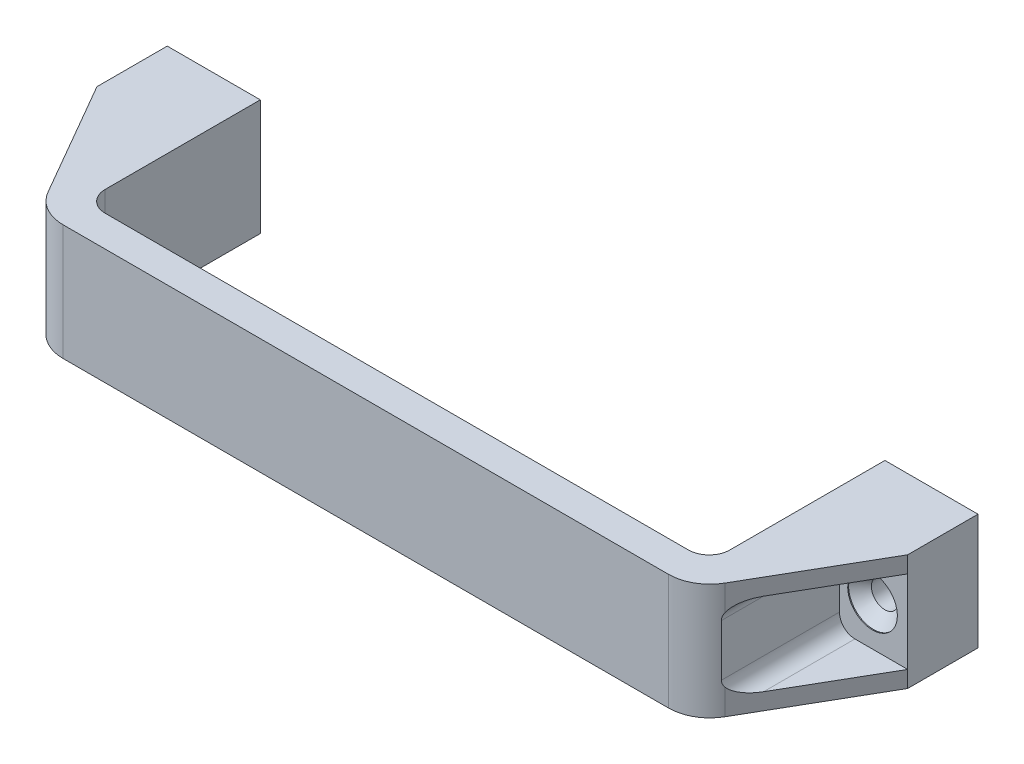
ISO-10303-21;
HEADER;
FILE_DESCRIPTION(('STEP AP214'),'2;1');
FILE_NAME('part.step','',(''),(''),'','','');
FILE_SCHEMA(('AUTOMOTIVE_DESIGN { 1 0 10303 214 1 1 1 1 }'));
ENDSEC;
DATA;
#1=APPLICATION_CONTEXT('core data for automotive mechanical design processes');
#2=APPLICATION_PROTOCOL_DEFINITION('international standard','automotive_design',2000,#1);
#3=PRODUCT_CONTEXT('',#1,'mechanical');
#4=PRODUCT('Part','Part','',(#3));
#5=PRODUCT_RELATED_PRODUCT_CATEGORY('part','',(#4));
#6=PRODUCT_DEFINITION_FORMATION('','',#4);
#7=PRODUCT_DEFINITION_CONTEXT('part definition',#1,'design');
#8=PRODUCT_DEFINITION('design','',#6,#7);
#9=PRODUCT_DEFINITION_SHAPE('','',#8);
#10=(LENGTH_UNIT() NAMED_UNIT(*) SI_UNIT(.MILLI.,.METRE.));
#11=(NAMED_UNIT(*) PLANE_ANGLE_UNIT() SI_UNIT($,.RADIAN.));
#12=(NAMED_UNIT(*) SI_UNIT($,.STERADIAN.) SOLID_ANGLE_UNIT());
#13=UNCERTAINTY_MEASURE_WITH_UNIT(LENGTH_MEASURE(1.E-05),#10,'distance_accuracy_value','');
#14=(GEOMETRIC_REPRESENTATION_CONTEXT(3) GLOBAL_UNCERTAINTY_ASSIGNED_CONTEXT((#13)) GLOBAL_UNIT_ASSIGNED_CONTEXT((#10,
#11,#12)) REPRESENTATION_CONTEXT('',''));
#15=CARTESIAN_POINT('',(0.,0.,0.));
#16=DIRECTION('',(0.,0.,1.));
#17=DIRECTION('',(1.,0.,0.));
#18=AXIS2_PLACEMENT_3D('',#15,#16,#17);
#19=CARTESIAN_POINT('',(0.,0.,16.7749999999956));
#20=DIRECTION('',(0.,0.,1.));
#21=DIRECTION('',(0.,-1.,0.));
#22=AXIS2_PLACEMENT_3D('',#19,#20,#21);
#23=CONICAL_SURFACE('',#22,5.99999999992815,0.785398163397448);
#24=CARTESIAN_POINT('',(0.,0.,14.025));
#25=DIRECTION('',(0.,0.,-1.));
#26=DIRECTION('',(0.,1.,0.));
#27=AXIS2_PLACEMENT_3D('',#24,#25,#26);
#28=CIRCLE('',#27,3.25);
#29=CARTESIAN_POINT('',(0.,3.25,14.025));
#30=VERTEX_POINT('',#29);
#31=EDGE_CURVE('E180',#30,#30,#28,.T.);
#32=ORIENTED_EDGE('',*,*,#31,.T.);
#33=EDGE_LOOP('',(#32));
#34=FACE_BOUND('',#33,.T.);
#35=CARTESIAN_POINT('',(0.,0.,16.775));
#36=DIRECTION('',(0.,0.,-1.));
#37=DIRECTION('',(0.,1.,0.));
#38=AXIS2_PLACEMENT_3D('',#35,#36,#37);
#39=CIRCLE('',#38,6.);
#40=CARTESIAN_POINT('',(0.,6.,16.775));
#41=VERTEX_POINT('',#40);
#42=EDGE_CURVE('E310',#41,#41,#39,.F.);
#43=ORIENTED_EDGE('',*,*,#42,.T.);
#44=EDGE_LOOP('',(#43));
#45=FACE_BOUND('',#44,.T.);
#46=ADVANCED_FACE('F14',(#34,#45),#23,.F.);
#47=CARTESIAN_POINT('',(179.,0.,16.7750000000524));
#48=DIRECTION('',(0.,0.,1.));
#49=DIRECTION('',(0.,-1.,0.));
#50=AXIS2_PLACEMENT_3D('',#47,#48,#49);
#51=CONICAL_SURFACE('',#50,6.00000000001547,0.785398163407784);
#52=CARTESIAN_POINT('',(179.,0.,14.025));
#53=DIRECTION('',(0.,0.,-1.));
#54=DIRECTION('',(0.,1.,0.));
#55=AXIS2_PLACEMENT_3D('',#52,#53,#54);
#56=CIRCLE('',#55,3.25);
#57=CARTESIAN_POINT('',(179.,3.25,14.025));
#58=VERTEX_POINT('',#57);
#59=EDGE_CURVE('E302',#58,#58,#56,.T.);
#60=ORIENTED_EDGE('',*,*,#59,.T.);
#61=EDGE_LOOP('',(#60));
#62=FACE_BOUND('',#61,.T.);
#63=CARTESIAN_POINT('',(179.,0.,16.775));
#64=DIRECTION('',(0.,0.,-1.));
#65=DIRECTION('',(0.,1.,0.));
#66=AXIS2_PLACEMENT_3D('',#63,#64,#65);
#67=CIRCLE('',#66,6.);
#68=CARTESIAN_POINT('',(179.,6.,16.775));
#69=VERTEX_POINT('',#68);
#70=EDGE_CURVE('E181',#69,#69,#67,.F.);
#71=ORIENTED_EDGE('',*,*,#70,.T.);
#72=EDGE_LOOP('',(#71));
#73=FACE_BOUND('',#72,.T.);
#74=ADVANCED_FACE('F477',(#62,#73),#51,.F.);
#75=CARTESIAN_POINT('',(0.,0.,16.8875));
#76=DIRECTION('',(0.,0.,-1.));
#77=DIRECTION('',(0.,1.,0.));
#78=AXIS2_PLACEMENT_3D('',#75,#76,#77);
#79=CYLINDRICAL_SURFACE('',#78,6.);
#80=ORIENTED_EDGE('',*,*,#42,.F.);
#81=EDGE_LOOP('',(#80));
#82=FACE_BOUND('',#81,.T.);
#83=CARTESIAN_POINT('',(0.,0.,16.999));
#84=DIRECTION('',(0.,0.,-1.));
#85=DIRECTION('',(0.,1.,0.));
#86=AXIS2_PLACEMENT_3D('',#83,#84,#85);
#87=CIRCLE('',#86,6.);
#88=CARTESIAN_POINT('',(0.,6.,16.999));
#89=VERTEX_POINT('',#88);
#90=EDGE_CURVE('E300',#89,#89,#87,.T.);
#91=ORIENTED_EDGE('',*,*,#90,.F.);
#92=EDGE_LOOP('',(#91));
#93=FACE_BOUND('',#92,.T.);
#94=ADVANCED_FACE('F474',(#82,#93),#79,.F.);
#95=CARTESIAN_POINT('',(179.,0.,16.8875));
#96=DIRECTION('',(0.,0.,-1.));
#97=DIRECTION('',(0.,1.,0.));
#98=AXIS2_PLACEMENT_3D('',#95,#96,#97);
#99=CYLINDRICAL_SURFACE('',#98,6.);
#100=ORIENTED_EDGE('',*,*,#70,.F.);
#101=EDGE_LOOP('',(#100));
#102=FACE_BOUND('',#101,.T.);
#103=CARTESIAN_POINT('',(179.,0.,16.999));
#104=DIRECTION('',(0.,0.,-1.));
#105=DIRECTION('',(0.,1.,0.));
#106=AXIS2_PLACEMENT_3D('',#103,#104,#105);
#107=CIRCLE('',#106,6.);
#108=CARTESIAN_POINT('',(179.,6.,16.999));
#109=VERTEX_POINT('',#108);
#110=EDGE_CURVE('E294',#109,#109,#107,.T.);
#111=ORIENTED_EDGE('',*,*,#110,.F.);
#112=EDGE_LOOP('',(#111));
#113=FACE_BOUND('',#112,.T.);
#114=ADVANCED_FACE('F471',(#102,#113),#99,.F.);
#115=CARTESIAN_POINT('',(-10.5,10.,16.999));
#116=DIRECTION('',(0.,1.,0.));
#117=DIRECTION('',(-1.,0.,0.));
#118=AXIS2_PLACEMENT_3D('',#115,#116,#117);
#119=PLANE('',#118);
#120=DIRECTION('',(1.,0.,0.));
#121=VECTOR('',#120,1.);
#122=CARTESIAN_POINT('',(89.5,10.,16.999));
#123=LINE('',#122,#121);
#124=CARTESIAN_POINT('',(4.25,10.,16.999));
#125=VERTEX_POINT('',#124);
#126=CARTESIAN_POINT('',(-8.5,10.,16.999));
#127=VERTEX_POINT('',#126);
#128=EDGE_CURVE('E295',#125,#127,#123,.F.);
#129=ORIENTED_EDGE('',*,*,#128,.F.);
#130=DIRECTION('',(0.,0.,-1.));
#131=VECTOR('',#130,1.);
#132=CARTESIAN_POINT('',(4.25,10.,16.999));
#133=LINE('',#132,#131);
#134=CARTESIAN_POINT('',(4.25,10.,39.0836477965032));
#135=VERTEX_POINT('',#134);
#136=EDGE_CURVE('E186',#125,#135,#133,.F.);
#137=ORIENTED_EDGE('',*,*,#136,.T.);
#138=DIRECTION('',(-0.5,0.,-0.866025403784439));
#139=VECTOR('',#138,1.);
#140=CARTESIAN_POINT('',(7.6658075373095,10.,45.));
#141=LINE('',#140,#139);
#142=CARTESIAN_POINT('',(-8.5,10.,17.));
#143=VERTEX_POINT('',#142);
#144=EDGE_CURVE('E183',#143,#135,#141,.F.);
#145=ORIENTED_EDGE('',*,*,#144,.F.);
#146=DIRECTION('',(0.,0.,1.));
#147=VECTOR('',#146,1.);
#148=CARTESIAN_POINT('',(-8.5,10.,17.));
#149=LINE('',#148,#147);
#150=EDGE_CURVE('E17',#127,#143,#149,.T.);
#151=ORIENTED_EDGE('',*,*,#150,.F.);
#152=EDGE_LOOP('',(#129,#137,#145,#151));
#153=FACE_BOUND('',#152,.T.);
#154=ADVANCED_FACE('F184',(#153),#119,.F.);
#155=CARTESIAN_POINT('',(0.,0.,7.0125));
#156=DIRECTION('',(0.,0.,-1.));
#157=DIRECTION('',(0.,1.,0.));
#158=AXIS2_PLACEMENT_3D('',#155,#156,#157);
#159=CYLINDRICAL_SURFACE('',#158,3.25);
#160=CARTESIAN_POINT('',(0.,0.,0.));
#161=DIRECTION('',(0.,0.,-1.));
#162=DIRECTION('',(0.,1.,0.));
#163=AXIS2_PLACEMENT_3D('',#160,#161,#162);
#164=CIRCLE('',#163,3.25);
#165=CARTESIAN_POINT('',(0.,3.25,0.));
#166=VERTEX_POINT('',#165);
#167=EDGE_CURVE('E252',#166,#166,#164,.F.);
#168=ORIENTED_EDGE('',*,*,#167,.F.);
#169=EDGE_LOOP('',(#168));
#170=FACE_BOUND('',#169,.T.);
#171=ORIENTED_EDGE('',*,*,#31,.F.);
#172=EDGE_LOOP('',(#171));
#173=FACE_BOUND('',#172,.T.);
#174=ADVANCED_FACE('F464',(#170,#173),#159,.F.);
#175=CARTESIAN_POINT('',(179.,0.,7.0125));
#176=DIRECTION('',(0.,0.,-1.));
#177=DIRECTION('',(0.,1.,0.));
#178=AXIS2_PLACEMENT_3D('',#175,#176,#177);
#179=CYLINDRICAL_SURFACE('',#178,3.25);
#180=CARTESIAN_POINT('',(179.,0.,0.));
#181=DIRECTION('',(0.,0.,-1.));
#182=DIRECTION('',(0.,1.,0.));
#183=AXIS2_PLACEMENT_3D('',#180,#181,#182);
#184=CIRCLE('',#183,3.25);
#185=CARTESIAN_POINT('',(179.,3.25,0.));
#186=VERTEX_POINT('',#185);
#187=EDGE_CURVE('E238',#186,#186,#184,.F.);
#188=ORIENTED_EDGE('',*,*,#187,.F.);
#189=EDGE_LOOP('',(#188));
#190=FACE_BOUND('',#189,.T.);
#191=ORIENTED_EDGE('',*,*,#59,.F.);
#192=EDGE_LOOP('',(#191));
#193=FACE_BOUND('',#192,.T.);
#194=ADVANCED_FACE('F460',(#190,#193),#179,.F.);
#195=CARTESIAN_POINT('',(4.25,-10.,16.999));
#196=DIRECTION('',(0.,-1.,0.));
#197=DIRECTION('',(1.,0.,0.));
#198=AXIS2_PLACEMENT_3D('',#195,#196,#197);
#199=PLANE('',#198);
#200=DIRECTION('',(-0.5,0.,-0.866025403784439));
#201=VECTOR('',#200,1.);
#202=CARTESIAN_POINT('',(7.6658075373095,-10.,45.));
#203=LINE('',#202,#201);
#204=CARTESIAN_POINT('',(4.25,-10.,39.0836477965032));
#205=VERTEX_POINT('',#204);
#206=CARTESIAN_POINT('',(-8.5,-10.,17.));
#207=VERTEX_POINT('',#206);
#208=EDGE_CURVE('E206',#205,#207,#203,.T.);
#209=ORIENTED_EDGE('',*,*,#208,.F.);
#210=DIRECTION('',(0.,0.,-1.));
#211=VECTOR('',#210,1.);
#212=CARTESIAN_POINT('',(4.25,-10.,16.999));
#213=LINE('',#212,#211);
#214=CARTESIAN_POINT('',(4.25,-10.,16.999));
#215=VERTEX_POINT('',#214);
#216=EDGE_CURVE('E266',#205,#215,#213,.T.);
#217=ORIENTED_EDGE('',*,*,#216,.T.);
#218=DIRECTION('',(1.,0.,0.));
#219=VECTOR('',#218,1.);
#220=CARTESIAN_POINT('',(89.5,-10.,16.999));
#221=LINE('',#220,#219);
#222=CARTESIAN_POINT('',(-8.5,-10.,16.999));
#223=VERTEX_POINT('',#222);
#224=EDGE_CURVE('E297',#223,#215,#221,.T.);
#225=ORIENTED_EDGE('',*,*,#224,.F.);
#226=DIRECTION('',(0.,0.,1.));
#227=VECTOR('',#226,1.);
#228=CARTESIAN_POINT('',(-8.5,-10.,17.));
#229=LINE('',#228,#227);
#230=EDGE_CURVE('E305',#207,#223,#229,.F.);
#231=ORIENTED_EDGE('',*,*,#230,.F.);
#232=EDGE_LOOP('',(#209,#217,#225,#231));
#233=FACE_BOUND('',#232,.T.);
#234=ADVANCED_FACE('F456',(#233),#199,.F.);
#235=CARTESIAN_POINT('',(89.5,0.,16.999));
#236=DIRECTION('',(0.,0.,1.));
#237=DIRECTION('',(0.,-1.,0.));
#238=AXIS2_PLACEMENT_3D('',#235,#236,#237);
#239=PLANE('',#238);
#240=CARTESIAN_POINT('',(4.25,6.25,16.999));
#241=DIRECTION('',(0.,0.,-1.));
#242=DIRECTION('',(0.,1.,0.));
#243=AXIS2_PLACEMENT_3D('',#240,#241,#242);
#244=CIRCLE('',#243,3.75);
#245=CARTESIAN_POINT('',(8.,6.25,16.999));
#246=VERTEX_POINT('',#245);
#247=EDGE_CURVE('E189',#246,#125,#244,.F.);
#248=ORIENTED_EDGE('',*,*,#247,.T.);
#249=ORIENTED_EDGE('',*,*,#128,.T.);
#250=DIRECTION('',(0.,-1.,0.));
#251=VECTOR('',#250,1.);
#252=CARTESIAN_POINT('',(-8.5,-14.,16.999));
#253=LINE('',#252,#251);
#254=EDGE_CURVE('E179',#223,#127,#253,.F.);
#255=ORIENTED_EDGE('',*,*,#254,.F.);
#256=ORIENTED_EDGE('',*,*,#224,.T.);
#257=CARTESIAN_POINT('',(4.25,-6.25,16.999));
#258=DIRECTION('',(0.,0.,-1.));
#259=DIRECTION('',(0.,1.,0.));
#260=AXIS2_PLACEMENT_3D('',#257,#258,#259);
#261=CIRCLE('',#260,3.75);
#262=CARTESIAN_POINT('',(8.,-6.25,16.999));
#263=VERTEX_POINT('',#262);
#264=EDGE_CURVE('E190',#215,#263,#261,.F.);
#265=ORIENTED_EDGE('',*,*,#264,.T.);
#266=DIRECTION('',(0.,1.,0.));
#267=VECTOR('',#266,1.);
#268=CARTESIAN_POINT('',(8.,6.25,16.999));
#269=LINE('',#268,#267);
#270=EDGE_CURVE('E260',#263,#246,#269,.T.);
#271=ORIENTED_EDGE('',*,*,#270,.T.);
#272=EDGE_LOOP('',(#248,#249,#255,#256,#265,#271));
#273=FACE_BOUND('',#272,.T.);
#274=ORIENTED_EDGE('',*,*,#90,.T.);
#275=EDGE_LOOP('',(#274));
#276=FACE_BOUND('',#275,.T.);
#277=ADVANCED_FACE('F452',(#273,#276),#239,.T.);
#278=CARTESIAN_POINT('',(174.75,10.,16.999));
#279=DIRECTION('',(0.,1.,0.));
#280=DIRECTION('',(-1.,0.,0.));
#281=AXIS2_PLACEMENT_3D('',#278,#279,#280);
#282=PLANE('',#281);
#283=DIRECTION('',(0.,0.,-1.));
#284=VECTOR('',#283,1.);
#285=CARTESIAN_POINT('',(174.75,10.,16.999));
#286=LINE('',#285,#284);
#287=CARTESIAN_POINT('',(174.75,10.,39.0836477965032));
#288=VERTEX_POINT('',#287);
#289=CARTESIAN_POINT('',(174.75,10.,16.999));
#290=VERTEX_POINT('',#289);
#291=EDGE_CURVE('E529',#288,#290,#286,.T.);
#292=ORIENTED_EDGE('',*,*,#291,.T.);
#293=DIRECTION('',(1.,0.,0.));
#294=VECTOR('',#293,1.);
#295=CARTESIAN_POINT('',(89.5,10.,16.999));
#296=LINE('',#295,#294);
#297=CARTESIAN_POINT('',(187.5,10.,16.999));
#298=VERTEX_POINT('',#297);
#299=EDGE_CURVE('E291',#298,#290,#296,.F.);
#300=ORIENTED_EDGE('',*,*,#299,.F.);
#301=DIRECTION('',(0.,0.,1.));
#302=VECTOR('',#301,1.);
#303=CARTESIAN_POINT('',(187.5,10.,0.));
#304=LINE('',#303,#302);
#305=CARTESIAN_POINT('',(187.5,10.,17.));
#306=VERTEX_POINT('',#305);
#307=EDGE_CURVE('E229',#306,#298,#304,.F.);
#308=ORIENTED_EDGE('',*,*,#307,.F.);
#309=DIRECTION('',(-0.5,0.,0.866025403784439));
#310=VECTOR('',#309,1.);
#311=CARTESIAN_POINT('',(187.5,10.,17.));
#312=LINE('',#311,#310);
#313=EDGE_CURVE('E277',#288,#306,#312,.F.);
#314=ORIENTED_EDGE('',*,*,#313,.F.);
#315=EDGE_LOOP('',(#292,#300,#308,#314));
#316=FACE_BOUND('',#315,.T.);
#317=ADVANCED_FACE('F448',(#316),#282,.F.);
#318=CARTESIAN_POINT('',(189.5,-10.,16.999));
#319=DIRECTION('',(0.,-1.,0.));
#320=DIRECTION('',(1.,0.,0.));
#321=AXIS2_PLACEMENT_3D('',#318,#319,#320);
#322=PLANE('',#321);
#323=DIRECTION('',(0.,0.,1.));
#324=VECTOR('',#323,1.);
#325=CARTESIAN_POINT('',(187.5,-10.,0.));
#326=LINE('',#325,#324);
#327=CARTESIAN_POINT('',(187.5,-10.,16.999));
#328=VERTEX_POINT('',#327);
#329=CARTESIAN_POINT('',(187.5,-10.,17.));
#330=VERTEX_POINT('',#329);
#331=EDGE_CURVE('E228',#328,#330,#326,.T.);
#332=ORIENTED_EDGE('',*,*,#331,.F.);
#333=DIRECTION('',(1.,0.,0.));
#334=VECTOR('',#333,1.);
#335=CARTESIAN_POINT('',(89.5,-10.,16.999));
#336=LINE('',#335,#334);
#337=CARTESIAN_POINT('',(174.75,-10.,16.999));
#338=VERTEX_POINT('',#337);
#339=EDGE_CURVE('E268',#338,#328,#336,.T.);
#340=ORIENTED_EDGE('',*,*,#339,.F.);
#341=DIRECTION('',(0.,0.,-1.));
#342=VECTOR('',#341,1.);
#343=CARTESIAN_POINT('',(174.75,-10.,16.999));
#344=LINE('',#343,#342);
#345=CARTESIAN_POINT('',(174.75,-10.,39.0836477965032));
#346=VERTEX_POINT('',#345);
#347=EDGE_CURVE('E522',#338,#346,#344,.F.);
#348=ORIENTED_EDGE('',*,*,#347,.T.);
#349=DIRECTION('',(-0.5,0.,0.866025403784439));
#350=VECTOR('',#349,1.);
#351=CARTESIAN_POINT('',(187.5,-10.,17.));
#352=LINE('',#351,#350);
#353=EDGE_CURVE('E218',#330,#346,#352,.T.);
#354=ORIENTED_EDGE('',*,*,#353,.F.);
#355=EDGE_LOOP('',(#332,#340,#348,#354));
#356=FACE_BOUND('',#355,.T.);
#357=ADVANCED_FACE('F444',(#356),#322,.F.);
#358=CARTESIAN_POINT('',(89.5,0.,16.999));
#359=DIRECTION('',(0.,0.,1.));
#360=DIRECTION('',(0.,-1.,0.));
#361=AXIS2_PLACEMENT_3D('',#358,#359,#360);
#362=PLANE('',#361);
#363=CARTESIAN_POINT('',(174.75,-6.25,16.999));
#364=DIRECTION('',(0.,0.,-1.));
#365=DIRECTION('',(0.,1.,0.));
#366=AXIS2_PLACEMENT_3D('',#363,#364,#365);
#367=CIRCLE('',#366,3.75);
#368=CARTESIAN_POINT('',(171.,-6.25,16.999));
#369=VERTEX_POINT('',#368);
#370=EDGE_CURVE('E524',#369,#338,#367,.F.);
#371=ORIENTED_EDGE('',*,*,#370,.T.);
#372=ORIENTED_EDGE('',*,*,#339,.T.);
#373=DIRECTION('',(0.,1.,0.));
#374=VECTOR('',#373,1.);
#375=CARTESIAN_POINT('',(187.5,-14.,16.999));
#376=LINE('',#375,#374);
#377=EDGE_CURVE('E225',#298,#328,#376,.F.);
#378=ORIENTED_EDGE('',*,*,#377,.F.);
#379=ORIENTED_EDGE('',*,*,#299,.T.);
#380=CARTESIAN_POINT('',(174.75,6.25,16.999));
#381=DIRECTION('',(0.,0.,-1.));
#382=DIRECTION('',(0.,1.,0.));
#383=AXIS2_PLACEMENT_3D('',#380,#381,#382);
#384=CIRCLE('',#383,3.75);
#385=CARTESIAN_POINT('',(171.,6.25,16.999));
#386=VERTEX_POINT('',#385);
#387=EDGE_CURVE('E530',#290,#386,#384,.F.);
#388=ORIENTED_EDGE('',*,*,#387,.T.);
#389=DIRECTION('',(0.,-1.,0.));
#390=VECTOR('',#389,1.);
#391=CARTESIAN_POINT('',(171.,-6.25,16.999));
#392=LINE('',#391,#390);
#393=EDGE_CURVE('E286',#386,#369,#392,.T.);
#394=ORIENTED_EDGE('',*,*,#393,.T.);
#395=EDGE_LOOP('',(#371,#372,#378,#379,#388,#394));
#396=FACE_BOUND('',#395,.T.);
#397=ORIENTED_EDGE('',*,*,#110,.T.);
#398=EDGE_LOOP('',(#397));
#399=FACE_BOUND('',#398,.T.);
#400=ADVANCED_FACE('F440',(#396,#399),#362,.T.);
#401=CARTESIAN_POINT('',(4.25,-6.25,16.999));
#402=DIRECTION('',(0.,0.,-1.));
#403=DIRECTION('',(0.,1.,0.));
#404=AXIS2_PLACEMENT_3D('',#401,#402,#403);
#405=CYLINDRICAL_SURFACE('',#404,3.75);
#406=CARTESIAN_POINT('',(8.,-6.25,45.5386549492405));
#407=CARTESIAN_POINT('',(8.00001562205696,-6.31524597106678,45.538667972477));
#408=CARTESIAN_POINT('',(7.9982976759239,-6.38048197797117,45.5360956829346));
#409=CARTESIAN_POINT('',(7.99151242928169,-6.51034359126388,45.5258808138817));
#410=CARTESIAN_POINT('',(7.98644707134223,-6.574969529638,45.5182411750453));
#411=CARTESIAN_POINT('',(7.97312415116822,-6.70271757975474,45.4980517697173));
#412=CARTESIAN_POINT('',(7.96488569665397,-6.7658463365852,45.4855313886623));
#413=CARTESIAN_POINT('',(7.94543597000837,-6.89049824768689,45.4557703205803));
#414=CARTESIAN_POINT('',(7.93422452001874,-6.95202130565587,45.4385293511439));
#415=CARTESIAN_POINT('',(7.89657344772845,-7.13326587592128,45.3801381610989));
#416=CARTESIAN_POINT('',(7.86607462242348,-7.25004707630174,45.3322572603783));
#417=CARTESIAN_POINT('',(7.79685972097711,-7.47309745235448,45.2208211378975));
#418=CARTESIAN_POINT('',(7.75814335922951,-7.57936626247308,45.1572653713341));
#419=CARTESIAN_POINT('',(7.70844823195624,-7.69986570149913,45.0731655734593));
#420=CARTESIAN_POINT('',(7.70004813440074,-7.71973701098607,45.0588711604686));
#421=CARTESIAN_POINT('',(7.68306454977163,-7.75898079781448,45.0297995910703));
#422=CARTESIAN_POINT('',(7.67448142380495,-7.77835411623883,45.0150233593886));
#423=CARTESIAN_POINT('',(7.66580753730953,-7.79750084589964,45.));
#424=B_SPLINE_CURVE_WITH_KNOTS('',3,(#406,#407,#408,#409,#410,#411,#412,#413,#414,#415,#416,
#417,#418,#419,#420,#421,#422,#423),.UNSPECIFIED.,.F.,.F.,(4,2,2,2,2,2,2,2,4),(0.,
0.195648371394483,0.391183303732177,0.585558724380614,0.779945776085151,1.16756137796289,
1.55519045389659,1.63282651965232,1.7103214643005),.UNSPECIFIED.);
#425=CARTESIAN_POINT('',(8.,-6.25,45.5386549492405));
#426=VERTEX_POINT('',#425);
#427=CARTESIAN_POINT('',(7.66580753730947,-7.79750084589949,45.));
#428=VERTEX_POINT('',#427);
#429=EDGE_CURVE('E426',#426,#428,#424,.T.);
#430=ORIENTED_EDGE('',*,*,#429,.F.);
#431=DIRECTION('',(0.,0.,1.));
#432=VECTOR('',#431,1.);
#433=CARTESIAN_POINT('',(8.,-6.25,16.999));
#434=LINE('',#433,#432);
#435=EDGE_CURVE('E261',#426,#263,#434,.F.);
#436=ORIENTED_EDGE('',*,*,#435,.T.);
#437=ORIENTED_EDGE('',*,*,#264,.F.);
#438=ORIENTED_EDGE('',*,*,#216,.F.);
#439=CARTESIAN_POINT('',(4.25,-6.25,39.0836477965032));
#440=DIRECTION('',(-0.866025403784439,0.,0.5));
#441=DIRECTION('',(-0.5,0.,-0.866025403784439));
#442=AXIS2_PLACEMENT_3D('',#439,#440,#441);
#443=ELLIPSE('',#442,7.5,3.75);
#444=EDGE_CURVE('E201',#428,#205,#443,.F.);
#445=ORIENTED_EDGE('',*,*,#444,.F.);
#446=EDGE_LOOP('',(#430,#436,#437,#438,#445));
#447=FACE_BOUND('',#446,.T.);
#448=ADVANCED_FACE('F436',(#447),#405,.F.);
#449=CARTESIAN_POINT('',(7.6658075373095,-14.,45.));
#450=DIRECTION('',(-0.866025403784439,0.,0.5));
#451=DIRECTION('',(-0.5,0.,-0.866025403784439));
#452=AXIS2_PLACEMENT_3D('',#449,#450,#451);
#453=PLANE('',#452);
#454=DIRECTION('',(-0.5,0.,-0.866025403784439));
#455=VECTOR('',#454,1.);
#456=CARTESIAN_POINT('',(7.6658075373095,14.,45.));
#457=LINE('',#456,#455);
#458=CARTESIAN_POINT('',(7.66580753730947,14.,45.));
#459=VERTEX_POINT('',#458);
#460=CARTESIAN_POINT('',(-8.5,14.,17.));
#461=VERTEX_POINT('',#460);
#462=EDGE_CURVE('E195',#459,#461,#457,.T.);
#463=ORIENTED_EDGE('',*,*,#462,.T.);
#464=DIRECTION('',(0.,-1.,0.));
#465=VECTOR('',#464,1.);
#466=CARTESIAN_POINT('',(-8.5,-14.,17.));
#467=LINE('',#466,#465);
#468=EDGE_CURVE('E176',#143,#461,#467,.F.);
#469=ORIENTED_EDGE('',*,*,#468,.F.);
#470=ORIENTED_EDGE('',*,*,#144,.T.);
#471=CARTESIAN_POINT('',(4.25,6.25,39.0836477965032));
#472=DIRECTION('',(-0.866025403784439,0.,0.5));
#473=DIRECTION('',(-0.5,0.,-0.866025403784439));
#474=AXIS2_PLACEMENT_3D('',#471,#472,#473);
#475=ELLIPSE('',#474,7.5,3.75);
#476=CARTESIAN_POINT('',(7.66580753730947,7.79750084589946,45.));
#477=VERTEX_POINT('',#476);
#478=EDGE_CURVE('E264',#135,#477,#475,.F.);
#479=ORIENTED_EDGE('',*,*,#478,.T.);
#480=DIRECTION('',(0.,-1.,0.));
#481=VECTOR('',#480,1.);
#482=CARTESIAN_POINT('',(7.66580753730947,-14.,45.));
#483=LINE('',#482,#481);
#484=EDGE_CURVE('E415',#459,#477,#483,.T.);
#485=ORIENTED_EDGE('',*,*,#484,.F.);
#486=EDGE_LOOP('',(#463,#469,#470,#479,#485));
#487=FACE_BOUND('',#486,.T.);
#488=ADVANCED_FACE('F193',(#487),#453,.T.);
#489=CARTESIAN_POINT('',(4.25,6.25,16.999));
#490=DIRECTION('',(0.,0.,-1.));
#491=DIRECTION('',(0.,1.,0.));
#492=AXIS2_PLACEMENT_3D('',#489,#490,#491);
#493=CYLINDRICAL_SURFACE('',#492,3.75);
#494=ORIENTED_EDGE('',*,*,#136,.F.);
#495=ORIENTED_EDGE('',*,*,#247,.F.);
#496=DIRECTION('',(0.,0.,1.));
#497=VECTOR('',#496,1.);
#498=CARTESIAN_POINT('',(8.,6.25,16.999));
#499=LINE('',#498,#497);
#500=CARTESIAN_POINT('',(8.,6.25,45.5386549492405));
#501=VERTEX_POINT('',#500);
#502=EDGE_CURVE('E258',#246,#501,#499,.T.);
#503=ORIENTED_EDGE('',*,*,#502,.T.);
#504=CARTESIAN_POINT('',(7.66580753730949,7.79750084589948,45.));
#505=CARTESIAN_POINT('',(7.68771705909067,7.74913801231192,45.0379508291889));
#506=CARTESIAN_POINT('',(7.70905818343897,7.69929886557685,45.0743358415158));
#507=CARTESIAN_POINT('',(7.75029080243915,7.59667354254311,45.1437127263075));
#508=CARTESIAN_POINT('',(7.77018096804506,7.54388474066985,45.1767014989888));
#509=CARTESIAN_POINT('',(7.82738473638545,7.38055751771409,45.2704717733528));
#510=CARTESIAN_POINT('',(7.86194797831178,7.26566666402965,45.3255729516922));
#511=CARTESIAN_POINT('',(7.92097848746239,7.02569647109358,45.4182719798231));
#512=CARTESIAN_POINT('',(7.94539102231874,6.90056614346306,45.4557750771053));
#513=CARTESIAN_POINT('',(7.9723990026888,6.70872711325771,45.496960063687));
#514=CARTESIAN_POINT('',(7.97979504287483,6.64421229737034,45.5081699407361));
#515=CARTESIAN_POINT('',(7.99124660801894,6.51422272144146,45.5254840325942));
#516=CARTESIAN_POINT('',(7.99530461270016,6.44874871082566,45.5315920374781));
#517=CARTESIAN_POINT('',(7.99842435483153,6.36094522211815,45.5362856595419));
#518=CARTESIAN_POINT('',(7.99901505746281,6.33876694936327,45.5371740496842));
#519=CARTESIAN_POINT('',(7.99980273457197,6.29439356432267,45.5383584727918));
#520=CARTESIAN_POINT('',(7.99999981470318,6.27219845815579,45.5386546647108));
#521=CARTESIAN_POINT('',(8.,6.25,45.5386549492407));
#522=B_SPLINE_CURVE_WITH_KNOTS('',3,(#504,#505,#506,#507,#508,#509,#510,#511,#512,#513,#514,
#515,#516,#517,#518,#519,#520,#521),.UNSPECIFIED.,.F.,.F.,(4,2,2,2,2,2,2,2,4),(0.,
0.19572522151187,0.391627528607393,0.785890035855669,1.1822516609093,1.37970936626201,
1.57702025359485,1.64362396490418,1.71020979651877),.UNSPECIFIED.);
#523=EDGE_CURVE('E407',#477,#501,#522,.T.);
#524=ORIENTED_EDGE('',*,*,#523,.F.);
#525=ORIENTED_EDGE('',*,*,#478,.F.);
#526=EDGE_LOOP('',(#494,#495,#503,#524,#525));
#527=FACE_BOUND('',#526,.T.);
#528=ADVANCED_FACE('F399',(#527),#493,.F.);
#529=CARTESIAN_POINT('',(8.,6.25,16.999));
#530=DIRECTION('',(1.,0.,0.));
#531=DIRECTION('',(0.,1.,0.));
#532=AXIS2_PLACEMENT_3D('',#529,#530,#531);
#533=PLANE('',#532);
#534=ORIENTED_EDGE('',*,*,#502,.F.);
#535=ORIENTED_EDGE('',*,*,#270,.F.);
#536=ORIENTED_EDGE('',*,*,#435,.F.);
#537=DIRECTION('',(0.,-1.,0.));
#538=VECTOR('',#537,1.);
#539=CARTESIAN_POINT('',(8.,-14.,45.5386549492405));
#540=LINE('',#539,#538);
#541=EDGE_CURVE('E256',#501,#426,#540,.T.);
#542=ORIENTED_EDGE('',*,*,#541,.F.);
#543=EDGE_LOOP('',(#534,#535,#536,#542));
#544=FACE_BOUND('',#543,.T.);
#545=ADVANCED_FACE('F395',(#544),#533,.F.);
#546=CARTESIAN_POINT('',(-8.5,-14.,0.));
#547=DIRECTION('',(0.,0.,-1.));
#548=DIRECTION('',(0.,1.,0.));
#549=AXIS2_PLACEMENT_3D('',#546,#547,#548);
#550=PLANE('',#549);
#551=DIRECTION('',(1.,0.,0.));
#552=VECTOR('',#551,1.);
#553=CARTESIAN_POINT('',(89.5,-14.,0.));
#554=LINE('',#553,#552);
#555=CARTESIAN_POINT('',(-8.5,-14.,0.));
#556=VERTEX_POINT('',#555);
#557=CARTESIAN_POINT('',(14.,-14.,0.));
#558=VERTEX_POINT('',#557);
#559=EDGE_CURVE('E253',#556,#558,#554,.T.);
#560=ORIENTED_EDGE('',*,*,#559,.F.);
#561=DIRECTION('',(0.,-1.,0.));
#562=VECTOR('',#561,1.);
#563=CARTESIAN_POINT('',(-8.5,-14.,0.));
#564=LINE('',#563,#562);
#565=CARTESIAN_POINT('',(-8.5,14.,0.));
#566=VERTEX_POINT('',#565);
#567=EDGE_CURVE('E196',#566,#556,#564,.T.);
#568=ORIENTED_EDGE('',*,*,#567,.F.);
#569=DIRECTION('',(1.,0.,0.));
#570=VECTOR('',#569,1.);
#571=CARTESIAN_POINT('',(89.5,14.,0.));
#572=LINE('',#571,#570);
#573=CARTESIAN_POINT('',(14.,14.,0.));
#574=VERTEX_POINT('',#573);
#575=EDGE_CURVE('E269',#566,#574,#572,.T.);
#576=ORIENTED_EDGE('',*,*,#575,.T.);
#577=DIRECTION('',(0.,1.,0.));
#578=VECTOR('',#577,1.);
#579=CARTESIAN_POINT('',(14.,-14.,0.));
#580=LINE('',#579,#578);
#581=EDGE_CURVE('E249',#558,#574,#580,.T.);
#582=ORIENTED_EDGE('',*,*,#581,.F.);
#583=EDGE_LOOP('',(#560,#568,#576,#582));
#584=FACE_BOUND('',#583,.T.);
#585=ORIENTED_EDGE('',*,*,#167,.T.);
#586=EDGE_LOOP('',(#585));
#587=FACE_BOUND('',#586,.T.);
#588=ADVANCED_FACE('F391',(#584,#587),#550,.T.);
#589=CARTESIAN_POINT('',(14.,-14.,0.));
#590=DIRECTION('',(1.,0.,0.));
#591=DIRECTION('',(0.,1.,0.));
#592=AXIS2_PLACEMENT_3D('',#589,#590,#591);
#593=PLANE('',#592);
#594=DIRECTION('',(0.,0.,1.));
#595=VECTOR('',#594,1.);
#596=CARTESIAN_POINT('',(14.,-14.,0.));
#597=LINE('',#596,#595);
#598=CARTESIAN_POINT('',(14.,-14.,37.5));
#599=VERTEX_POINT('',#598);
#600=EDGE_CURVE('E255',#558,#599,#597,.T.);
#601=ORIENTED_EDGE('',*,*,#600,.F.);
#602=ORIENTED_EDGE('',*,*,#581,.T.);
#603=DIRECTION('',(0.,0.,1.));
#604=VECTOR('',#603,1.);
#605=CARTESIAN_POINT('',(14.,14.,0.));
#606=LINE('',#605,#604);
#607=CARTESIAN_POINT('',(14.,14.,37.5));
#608=VERTEX_POINT('',#607);
#609=EDGE_CURVE('E272',#574,#608,#606,.T.);
#610=ORIENTED_EDGE('',*,*,#609,.T.);
#611=DIRECTION('',(0.,-1.,0.));
#612=VECTOR('',#611,1.);
#613=CARTESIAN_POINT('',(14.,-14.,37.5));
#614=LINE('',#613,#612);
#615=EDGE_CURVE('E247',#608,#599,#614,.T.);
#616=ORIENTED_EDGE('',*,*,#615,.T.);
#617=EDGE_LOOP('',(#601,#602,#610,#616));
#618=FACE_BOUND('',#617,.T.);
#619=ADVANCED_FACE('F387',(#618),#593,.T.);
#620=CARTESIAN_POINT('',(19.,-14.,37.5));
#621=DIRECTION('',(0.,-1.,0.));
#622=DIRECTION('',(1.,0.,0.));
#623=AXIS2_PLACEMENT_3D('',#620,#621,#622);
#624=CYLINDRICAL_SURFACE('',#623,5.);
#625=DIRECTION('',(0.,1.,0.));
#626=VECTOR('',#625,1.);
#627=CARTESIAN_POINT('',(19.,-14.,42.5));
#628=LINE('',#627,#626);
#629=CARTESIAN_POINT('',(19.,-14.,42.5));
#630=VERTEX_POINT('',#629);
#631=CARTESIAN_POINT('',(19.,14.,42.5));
#632=VERTEX_POINT('',#631);
#633=EDGE_CURVE('E244',#630,#632,#628,.T.);
#634=ORIENTED_EDGE('',*,*,#633,.F.);
#635=CARTESIAN_POINT('',(19.,-14.,37.5));
#636=DIRECTION('',(0.,-1.,0.));
#637=DIRECTION('',(1.,0.,0.));
#638=AXIS2_PLACEMENT_3D('',#635,#636,#637);
#639=CIRCLE('',#638,5.);
#640=EDGE_CURVE('E416',#599,#630,#639,.F.);
#641=ORIENTED_EDGE('',*,*,#640,.F.);
#642=ORIENTED_EDGE('',*,*,#615,.F.);
#643=CARTESIAN_POINT('',(19.,14.,37.5));
#644=DIRECTION('',(0.,-1.,0.));
#645=DIRECTION('',(1.,0.,0.));
#646=AXIS2_PLACEMENT_3D('',#643,#644,#645);
#647=CIRCLE('',#646,5.);
#648=EDGE_CURVE('E516',#608,#632,#647,.F.);
#649=ORIENTED_EDGE('',*,*,#648,.T.);
#650=EDGE_LOOP('',(#634,#641,#642,#649));
#651=FACE_BOUND('',#650,.T.);
#652=ADVANCED_FACE('F383',(#651),#624,.F.);
#653=CARTESIAN_POINT('',(19.,-14.,42.5));
#654=DIRECTION('',(0.,0.,-1.));
#655=DIRECTION('',(0.,1.,0.));
#656=AXIS2_PLACEMENT_3D('',#653,#654,#655);
#657=PLANE('',#656);
#658=DIRECTION('',(1.,0.,0.));
#659=VECTOR('',#658,1.);
#660=CARTESIAN_POINT('',(89.5,-14.,42.5));
#661=LINE('',#660,#659);
#662=CARTESIAN_POINT('',(160.,-14.,42.5));
#663=VERTEX_POINT('',#662);
#664=EDGE_CURVE('E575',#630,#663,#661,.T.);
#665=ORIENTED_EDGE('',*,*,#664,.F.);
#666=ORIENTED_EDGE('',*,*,#633,.T.);
#667=DIRECTION('',(1.,0.,0.));
#668=VECTOR('',#667,1.);
#669=CARTESIAN_POINT('',(89.5,14.,42.5));
#670=LINE('',#669,#668);
#671=CARTESIAN_POINT('',(160.,14.,42.5));
#672=VERTEX_POINT('',#671);
#673=EDGE_CURVE('E514',#632,#672,#670,.T.);
#674=ORIENTED_EDGE('',*,*,#673,.T.);
#675=DIRECTION('',(0.,-1.,0.));
#676=VECTOR('',#675,1.);
#677=CARTESIAN_POINT('',(160.,-14.,42.5));
#678=LINE('',#677,#676);
#679=EDGE_CURVE('E242',#672,#663,#678,.T.);
#680=ORIENTED_EDGE('',*,*,#679,.T.);
#681=EDGE_LOOP('',(#665,#666,#674,#680));
#682=FACE_BOUND('',#681,.T.);
#683=ADVANCED_FACE('F379',(#682),#657,.T.);
#684=CARTESIAN_POINT('',(160.,-14.,37.5));
#685=DIRECTION('',(0.,-1.,0.));
#686=DIRECTION('',(1.,0.,0.));
#687=AXIS2_PLACEMENT_3D('',#684,#685,#686);
#688=CYLINDRICAL_SURFACE('',#687,5.);
#689=DIRECTION('',(0.,-1.,0.));
#690=VECTOR('',#689,1.);
#691=CARTESIAN_POINT('',(165.,-14.,37.5));
#692=LINE('',#691,#690);
#693=CARTESIAN_POINT('',(165.,-14.,37.5));
#694=VERTEX_POINT('',#693);
#695=CARTESIAN_POINT('',(165.,14.,37.5));
#696=VERTEX_POINT('',#695);
#697=EDGE_CURVE('E239',#694,#696,#692,.F.);
#698=ORIENTED_EDGE('',*,*,#697,.F.);
#699=CARTESIAN_POINT('',(160.,-14.,37.5));
#700=DIRECTION('',(0.,-1.,0.));
#701=DIRECTION('',(1.,0.,0.));
#702=AXIS2_PLACEMENT_3D('',#699,#700,#701);
#703=CIRCLE('',#702,5.);
#704=EDGE_CURVE('E574',#663,#694,#703,.F.);
#705=ORIENTED_EDGE('',*,*,#704,.F.);
#706=ORIENTED_EDGE('',*,*,#679,.F.);
#707=CARTESIAN_POINT('',(160.,14.,37.5));
#708=DIRECTION('',(0.,-1.,0.));
#709=DIRECTION('',(1.,0.,0.));
#710=AXIS2_PLACEMENT_3D('',#707,#708,#709);
#711=CIRCLE('',#710,5.);
#712=EDGE_CURVE('E434',#672,#696,#711,.F.);
#713=ORIENTED_EDGE('',*,*,#712,.T.);
#714=EDGE_LOOP('',(#698,#705,#706,#713));
#715=FACE_BOUND('',#714,.T.);
#716=ADVANCED_FACE('F375',(#715),#688,.F.);
#717=CARTESIAN_POINT('',(165.,-14.,37.5));
#718=DIRECTION('',(-1.,0.,0.));
#719=DIRECTION('',(0.,-1.,0.));
#720=AXIS2_PLACEMENT_3D('',#717,#718,#719);
#721=PLANE('',#720);
#722=DIRECTION('',(0.,0.,1.));
#723=VECTOR('',#722,1.);
#724=CARTESIAN_POINT('',(165.,-14.,0.));
#725=LINE('',#724,#723);
#726=CARTESIAN_POINT('',(165.,-14.,0.));
#727=VERTEX_POINT('',#726);
#728=EDGE_CURVE('E234',#694,#727,#725,.F.);
#729=ORIENTED_EDGE('',*,*,#728,.F.);
#730=ORIENTED_EDGE('',*,*,#697,.T.);
#731=DIRECTION('',(0.,0.,1.));
#732=VECTOR('',#731,1.);
#733=CARTESIAN_POINT('',(165.,14.,0.));
#734=LINE('',#733,#732);
#735=CARTESIAN_POINT('',(165.,14.,0.));
#736=VERTEX_POINT('',#735);
#737=EDGE_CURVE('E285',#696,#736,#734,.F.);
#738=ORIENTED_EDGE('',*,*,#737,.T.);
#739=DIRECTION('',(0.,1.,0.));
#740=VECTOR('',#739,1.);
#741=CARTESIAN_POINT('',(165.,-14.,0.));
#742=LINE('',#741,#740);
#743=EDGE_CURVE('E235',#727,#736,#742,.T.);
#744=ORIENTED_EDGE('',*,*,#743,.F.);
#745=EDGE_LOOP('',(#729,#730,#738,#744));
#746=FACE_BOUND('',#745,.T.);
#747=ADVANCED_FACE('F371',(#746),#721,.T.);
#748=CARTESIAN_POINT('',(165.,-14.,0.));
#749=DIRECTION('',(0.,0.,-1.));
#750=DIRECTION('',(0.,1.,0.));
#751=AXIS2_PLACEMENT_3D('',#748,#749,#750);
#752=PLANE('',#751);
#753=DIRECTION('',(1.,0.,0.));
#754=VECTOR('',#753,1.);
#755=CARTESIAN_POINT('',(89.5,-14.,0.));
#756=LINE('',#755,#754);
#757=CARTESIAN_POINT('',(187.5,-14.,0.));
#758=VERTEX_POINT('',#757);
#759=EDGE_CURVE('E224',#727,#758,#756,.T.);
#760=ORIENTED_EDGE('',*,*,#759,.F.);
#761=ORIENTED_EDGE('',*,*,#743,.T.);
#762=DIRECTION('',(1.,0.,0.));
#763=VECTOR('',#762,1.);
#764=CARTESIAN_POINT('',(89.5,14.,0.));
#765=LINE('',#764,#763);
#766=CARTESIAN_POINT('',(187.5,14.,0.));
#767=VERTEX_POINT('',#766);
#768=EDGE_CURVE('E282',#736,#767,#765,.T.);
#769=ORIENTED_EDGE('',*,*,#768,.T.);
#770=DIRECTION('',(0.,1.,0.));
#771=VECTOR('',#770,1.);
#772=CARTESIAN_POINT('',(187.5,-14.,0.));
#773=LINE('',#772,#771);
#774=EDGE_CURVE('E209',#758,#767,#773,.T.);
#775=ORIENTED_EDGE('',*,*,#774,.F.);
#776=EDGE_LOOP('',(#760,#761,#769,#775));
#777=FACE_BOUND('',#776,.T.);
#778=ORIENTED_EDGE('',*,*,#187,.T.);
#779=EDGE_LOOP('',(#778));
#780=FACE_BOUND('',#779,.T.);
#781=ADVANCED_FACE('F367',(#777,#780),#752,.T.);
#782=CARTESIAN_POINT('',(187.5,-14.,0.));
#783=DIRECTION('',(1.,0.,0.));
#784=DIRECTION('',(0.,1.,0.));
#785=AXIS2_PLACEMENT_3D('',#782,#783,#784);
#786=PLANE('',#785);
#787=DIRECTION('',(0.,0.,1.));
#788=VECTOR('',#787,1.);
#789=CARTESIAN_POINT('',(187.5,14.,0.));
#790=LINE('',#789,#788);
#791=CARTESIAN_POINT('',(187.5,14.,17.));
#792=VERTEX_POINT('',#791);
#793=EDGE_CURVE('E278',#767,#792,#790,.T.);
#794=ORIENTED_EDGE('',*,*,#793,.T.);
#795=DIRECTION('',(0.,-1.,0.));
#796=VECTOR('',#795,1.);
#797=CARTESIAN_POINT('',(187.5,-14.,17.));
#798=LINE('',#797,#796);
#799=EDGE_CURVE('E219',#306,#792,#798,.F.);
#800=ORIENTED_EDGE('',*,*,#799,.F.);
#801=ORIENTED_EDGE('',*,*,#307,.T.);
#802=ORIENTED_EDGE('',*,*,#377,.T.);
#803=ORIENTED_EDGE('',*,*,#331,.T.);
#804=DIRECTION('',(0.,-1.,0.));
#805=VECTOR('',#804,1.);
#806=CARTESIAN_POINT('',(187.5,-14.,17.));
#807=LINE('',#806,#805);
#808=CARTESIAN_POINT('',(187.5,-14.,17.));
#809=VERTEX_POINT('',#808);
#810=EDGE_CURVE('E215',#809,#330,#807,.F.);
#811=ORIENTED_EDGE('',*,*,#810,.F.);
#812=DIRECTION('',(0.,0.,1.));
#813=VECTOR('',#812,1.);
#814=CARTESIAN_POINT('',(187.5,-14.,0.));
#815=LINE('',#814,#813);
#816=EDGE_CURVE('E220',#758,#809,#815,.T.);
#817=ORIENTED_EDGE('',*,*,#816,.F.);
#818=ORIENTED_EDGE('',*,*,#774,.T.);
#819=EDGE_LOOP('',(#794,#800,#801,#802,#803,#811,#817,#818));
#820=FACE_BOUND('',#819,.T.);
#821=ADVANCED_FACE('F363',(#820),#786,.T.);
#822=CARTESIAN_POINT('',(7.6658075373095,-14.,45.));
#823=DIRECTION('',(-0.866025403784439,0.,0.5));
#824=DIRECTION('',(-0.5,0.,-0.866025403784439));
#825=AXIS2_PLACEMENT_3D('',#822,#823,#824);
#826=PLANE('',#825);
#827=DIRECTION('',(0.,-1.,0.));
#828=VECTOR('',#827,1.);
#829=CARTESIAN_POINT('',(7.66580753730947,-14.,45.));
#830=LINE('',#829,#828);
#831=CARTESIAN_POINT('',(7.66580753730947,-14.,45.));
#832=VERTEX_POINT('',#831);
#833=EDGE_CURVE('E433',#428,#832,#830,.T.);
#834=ORIENTED_EDGE('',*,*,#833,.F.);
#835=ORIENTED_EDGE('',*,*,#444,.T.);
#836=ORIENTED_EDGE('',*,*,#208,.T.);
#837=DIRECTION('',(0.,-1.,0.));
#838=VECTOR('',#837,1.);
#839=CARTESIAN_POINT('',(-8.5,-14.,17.));
#840=LINE('',#839,#838);
#841=CARTESIAN_POINT('',(-8.5,-14.,17.));
#842=VERTEX_POINT('',#841);
#843=EDGE_CURVE('E199',#842,#207,#840,.F.);
#844=ORIENTED_EDGE('',*,*,#843,.F.);
#845=DIRECTION('',(-0.5,0.,-0.866025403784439));
#846=VECTOR('',#845,1.);
#847=CARTESIAN_POINT('',(7.6658075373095,-14.,45.));
#848=LINE('',#847,#846);
#849=EDGE_CURVE('E214',#832,#842,#848,.T.);
#850=ORIENTED_EDGE('',*,*,#849,.F.);
#851=EDGE_LOOP('',(#834,#835,#836,#844,#850));
#852=FACE_BOUND('',#851,.T.);
#853=ADVANCED_FACE('F360',(#852),#826,.T.);
#854=CARTESIAN_POINT('',(-8.5,-14.,17.));
#855=DIRECTION('',(-1.,0.,0.));
#856=DIRECTION('',(0.,-1.,0.));
#857=AXIS2_PLACEMENT_3D('',#854,#855,#856);
#858=PLANE('',#857);
#859=DIRECTION('',(0.,0.,1.));
#860=VECTOR('',#859,1.);
#861=CARTESIAN_POINT('',(-8.5,-14.,0.));
#862=LINE('',#861,#860);
#863=EDGE_CURVE('E210',#842,#556,#862,.F.);
#864=ORIENTED_EDGE('',*,*,#863,.F.);
#865=ORIENTED_EDGE('',*,*,#843,.T.);
#866=ORIENTED_EDGE('',*,*,#230,.T.);
#867=ORIENTED_EDGE('',*,*,#254,.T.);
#868=ORIENTED_EDGE('',*,*,#150,.T.);
#869=ORIENTED_EDGE('',*,*,#468,.T.);
#870=DIRECTION('',(0.,0.,1.));
#871=VECTOR('',#870,1.);
#872=CARTESIAN_POINT('',(-8.5,14.,0.));
#873=LINE('',#872,#871);
#874=EDGE_CURVE('E273',#461,#566,#873,.F.);
#875=ORIENTED_EDGE('',*,*,#874,.T.);
#876=ORIENTED_EDGE('',*,*,#567,.T.);
#877=EDGE_LOOP('',(#864,#865,#866,#867,#868,#869,#875,#876));
#878=FACE_BOUND('',#877,.T.);
#879=ADVANCED_FACE('F172',(#878),#858,.T.);
#880=CARTESIAN_POINT('',(174.75,6.25,16.999));
#881=DIRECTION('',(0.,0.,-1.));
#882=DIRECTION('',(0.,1.,0.));
#883=AXIS2_PLACEMENT_3D('',#880,#881,#882);
#884=CYLINDRICAL_SURFACE('',#883,3.75);
#885=DIRECTION('',(0.,0.,1.));
#886=VECTOR('',#885,1.);
#887=CARTESIAN_POINT('',(171.,6.25,16.999));
#888=LINE('',#887,#886);
#889=CARTESIAN_POINT('',(171.,6.25,45.5386549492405));
#890=VERTEX_POINT('',#889);
#891=EDGE_CURVE('E289',#890,#386,#888,.F.);
#892=ORIENTED_EDGE('',*,*,#891,.T.);
#893=ORIENTED_EDGE('',*,*,#387,.F.);
#894=ORIENTED_EDGE('',*,*,#291,.F.);
#895=CARTESIAN_POINT('',(174.75,6.25,39.0836477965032));
#896=DIRECTION('',(0.866025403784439,0.,0.5));
#897=DIRECTION('',(0.5,0.,-0.866025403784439));
#898=AXIS2_PLACEMENT_3D('',#895,#896,#897);
#899=ELLIPSE('',#898,7.5,3.75);
#900=CARTESIAN_POINT('',(171.33419246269,7.79750084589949,45.));
#901=VERTEX_POINT('',#900);
#902=EDGE_CURVE('E528',#901,#288,#899,.F.);
#903=ORIENTED_EDGE('',*,*,#902,.F.);
#904=CARTESIAN_POINT('',(171.,6.25,45.5386549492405));
#905=CARTESIAN_POINT('',(170.999984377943,6.31524597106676,45.5386679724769));
#906=CARTESIAN_POINT('',(171.001702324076,6.38048197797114,45.5360956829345));
#907=CARTESIAN_POINT('',(171.008487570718,6.51034359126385,45.5258808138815));
#908=CARTESIAN_POINT('',(171.013552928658,6.57496952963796,45.5182411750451));
#909=CARTESIAN_POINT('',(171.026875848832,6.70271757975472,45.4980517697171));
#910=CARTESIAN_POINT('',(171.035114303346,6.76584633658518,45.4855313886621));
#911=CARTESIAN_POINT('',(171.054564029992,6.89049824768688,45.4557703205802));
#912=CARTESIAN_POINT('',(171.065775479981,6.95202130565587,45.4385293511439));
#913=CARTESIAN_POINT('',(171.103426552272,7.13326587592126,45.3801381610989));
#914=CARTESIAN_POINT('',(171.133925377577,7.25004707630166,45.3322572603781));
#915=CARTESIAN_POINT('',(171.203140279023,7.47309745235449,45.2208211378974));
#916=CARTESIAN_POINT('',(171.24185664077,7.57936626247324,45.1572653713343));
#917=CARTESIAN_POINT('',(171.291551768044,7.69986570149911,45.0731655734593));
#918=CARTESIAN_POINT('',(171.299951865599,7.71973701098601,45.0588711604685));
#919=CARTESIAN_POINT('',(171.316935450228,7.75898079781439,45.0297995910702));
#920=CARTESIAN_POINT('',(171.325518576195,7.77835411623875,45.0150233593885));
#921=CARTESIAN_POINT('',(171.33419246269,7.79750084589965,45.));
#922=B_SPLINE_CURVE_WITH_KNOTS('',3,(#904,#905,#906,#907,#908,#909,#910,#911,#912,#913,#914,
#915,#916,#917,#918,#919,#920,#921),.UNSPECIFIED.,.F.,.F.,(4,2,2,2,2,2,2,2,4),(0.,
0.195648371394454,0.391183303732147,0.585558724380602,0.779945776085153,1.16756137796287,
1.55519045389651,1.63282651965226,1.71032146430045),.UNSPECIFIED.);
#923=EDGE_CURVE('E213',#890,#901,#922,.T.);
#924=ORIENTED_EDGE('',*,*,#923,.F.);
#925=EDGE_LOOP('',(#892,#893,#894,#903,#924));
#926=FACE_BOUND('',#925,.T.);
#927=ADVANCED_FACE('F351',(#926),#884,.F.);
#928=CARTESIAN_POINT('',(187.5,-14.,17.));
#929=DIRECTION('',(0.866025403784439,0.,0.5));
#930=DIRECTION('',(-0.5,0.,0.866025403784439));
#931=AXIS2_PLACEMENT_3D('',#928,#929,#930);
#932=PLANE('',#931);
#933=DIRECTION('',(-0.5,0.,0.866025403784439));
#934=VECTOR('',#933,1.);
#935=CARTESIAN_POINT('',(187.5,14.,17.));
#936=LINE('',#935,#934);
#937=CARTESIAN_POINT('',(171.33419246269,14.,45.));
#938=VERTEX_POINT('',#937);
#939=EDGE_CURVE('E281',#792,#938,#936,.T.);
#940=ORIENTED_EDGE('',*,*,#939,.T.);
#941=DIRECTION('',(0.,-1.,0.));
#942=VECTOR('',#941,1.);
#943=CARTESIAN_POINT('',(171.33419246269,-14.,45.));
#944=LINE('',#943,#942);
#945=EDGE_CURVE('E347',#901,#938,#944,.F.);
#946=ORIENTED_EDGE('',*,*,#945,.F.);
#947=ORIENTED_EDGE('',*,*,#902,.T.);
#948=ORIENTED_EDGE('',*,*,#313,.T.);
#949=ORIENTED_EDGE('',*,*,#799,.T.);
#950=EDGE_LOOP('',(#940,#946,#947,#948,#949));
#951=FACE_BOUND('',#950,.T.);
#952=ADVANCED_FACE('F356',(#951),#932,.T.);
#953=CARTESIAN_POINT('',(187.5,-14.,17.));
#954=DIRECTION('',(0.866025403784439,0.,0.5));
#955=DIRECTION('',(-0.5,0.,0.866025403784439));
#956=AXIS2_PLACEMENT_3D('',#953,#954,#955);
#957=PLANE('',#956);
#958=ORIENTED_EDGE('',*,*,#810,.T.);
#959=ORIENTED_EDGE('',*,*,#353,.T.);
#960=CARTESIAN_POINT('',(174.75,-6.25,39.0836477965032));
#961=DIRECTION('',(0.866025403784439,0.,0.5));
#962=DIRECTION('',(0.5,0.,-0.866025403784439));
#963=AXIS2_PLACEMENT_3D('',#960,#961,#962);
#964=ELLIPSE('',#963,7.5,3.75);
#965=CARTESIAN_POINT('',(171.33419246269,-7.79750084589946,45.));
#966=VERTEX_POINT('',#965);
#967=EDGE_CURVE('E521',#346,#966,#964,.F.);
#968=ORIENTED_EDGE('',*,*,#967,.T.);
#969=DIRECTION('',(0.,-1.,0.));
#970=VECTOR('',#969,1.);
#971=CARTESIAN_POINT('',(171.33419246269,-14.,45.));
#972=LINE('',#971,#970);
#973=CARTESIAN_POINT('',(171.33419246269,-14.,45.));
#974=VERTEX_POINT('',#973);
#975=EDGE_CURVE('E323',#974,#966,#972,.F.);
#976=ORIENTED_EDGE('',*,*,#975,.F.);
#977=DIRECTION('',(-0.5,0.,0.866025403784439));
#978=VECTOR('',#977,1.);
#979=CARTESIAN_POINT('',(187.5,-14.,17.));
#980=LINE('',#979,#978);
#981=EDGE_CURVE('E223',#809,#974,#980,.T.);
#982=ORIENTED_EDGE('',*,*,#981,.F.);
#983=EDGE_LOOP('',(#958,#959,#968,#976,#982));
#984=FACE_BOUND('',#983,.T.);
#985=ADVANCED_FACE('F596',(#984),#957,.T.);
#986=CARTESIAN_POINT('',(174.75,-6.25,16.999));
#987=DIRECTION('',(0.,0.,-1.));
#988=DIRECTION('',(0.,1.,0.));
#989=AXIS2_PLACEMENT_3D('',#986,#987,#988);
#990=CYLINDRICAL_SURFACE('',#989,3.75);
#991=ORIENTED_EDGE('',*,*,#967,.F.);
#992=ORIENTED_EDGE('',*,*,#347,.F.);
#993=ORIENTED_EDGE('',*,*,#370,.F.);
#994=DIRECTION('',(0.,0.,1.));
#995=VECTOR('',#994,1.);
#996=CARTESIAN_POINT('',(171.,-6.25,16.999));
#997=LINE('',#996,#995);
#998=CARTESIAN_POINT('',(171.,-6.25,45.5386549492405));
#999=VERTEX_POINT('',#998);
#1000=EDGE_CURVE('E288',#369,#999,#997,.T.);
#1001=ORIENTED_EDGE('',*,*,#1000,.T.);
#1002=CARTESIAN_POINT('',(171.33419246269,-7.7975008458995,45.));
#1003=CARTESIAN_POINT('',(171.312282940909,-7.74913801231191,45.0379508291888));
#1004=CARTESIAN_POINT('',(171.290941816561,-7.69929886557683,45.0743358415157));
#1005=CARTESIAN_POINT('',(171.249709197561,-7.59667354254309,45.1437127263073));
#1006=CARTESIAN_POINT('',(171.229819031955,-7.54388474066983,45.1767014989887));
#1007=CARTESIAN_POINT('',(171.172615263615,-7.38055751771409,45.2704717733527));
#1008=CARTESIAN_POINT('',(171.138052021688,-7.26566666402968,45.3255729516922));
#1009=CARTESIAN_POINT('',(171.079021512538,-7.02569647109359,45.4182719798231));
#1010=CARTESIAN_POINT('',(171.054608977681,-6.90056614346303,45.4557750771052));
#1011=CARTESIAN_POINT('',(171.027600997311,-6.70872711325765,45.4969600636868));
#1012=CARTESIAN_POINT('',(171.020204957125,-6.64421229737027,45.5081699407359));
#1013=CARTESIAN_POINT('',(171.008753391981,-6.51422272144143,45.5254840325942));
#1014=CARTESIAN_POINT('',(171.004695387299,-6.44874871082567,45.5315920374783));
#1015=CARTESIAN_POINT('',(171.001575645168,-6.36094522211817,45.5362856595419));
#1016=CARTESIAN_POINT('',(171.000984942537,-6.33876694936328,45.537174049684));
#1017=CARTESIAN_POINT('',(171.000197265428,-6.29439356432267,45.5383584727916));
#1018=CARTESIAN_POINT('',(171.000000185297,-6.27219845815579,45.5386546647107));
#1019=CARTESIAN_POINT('',(171.,-6.25,45.5386549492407));
#1020=B_SPLINE_CURVE_WITH_KNOTS('',3,(#1002,#1003,#1004,#1005,#1006,#1007,#1008,#1009,#1010,
#1011,#1012,#1013,#1014,#1015,#1016,#1017,#1018,#1019),.UNSPECIFIED.,.F.,.F.,(4,2,2,2,2,2,2,2,
4),(0.,0.195725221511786,0.391627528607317,0.785890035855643,1.18225166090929,1.37970936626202,
1.5770202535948,1.64362396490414,1.71020979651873),.UNSPECIFIED.);
#1021=EDGE_CURVE('E313',#966,#999,#1020,.T.);
#1022=ORIENTED_EDGE('',*,*,#1021,.F.);
#1023=EDGE_LOOP('',(#991,#992,#993,#1001,#1022));
#1024=FACE_BOUND('',#1023,.T.);
#1025=ADVANCED_FACE('F325',(#1024),#990,.F.);
#1026=CARTESIAN_POINT('',(171.,-6.25,16.999));
#1027=DIRECTION('',(-1.,0.,0.));
#1028=DIRECTION('',(0.,-1.,0.));
#1029=AXIS2_PLACEMENT_3D('',#1026,#1027,#1028);
#1030=PLANE('',#1029);
#1031=ORIENTED_EDGE('',*,*,#1000,.F.);
#1032=ORIENTED_EDGE('',*,*,#393,.F.);
#1033=ORIENTED_EDGE('',*,*,#891,.F.);
#1034=DIRECTION('',(0.,-1.,0.));
#1035=VECTOR('',#1034,1.);
#1036=CARTESIAN_POINT('',(171.,-14.,45.5386549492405));
#1037=LINE('',#1036,#1035);
#1038=EDGE_CURVE('E322',#999,#890,#1037,.F.);
#1039=ORIENTED_EDGE('',*,*,#1038,.F.);
#1040=EDGE_LOOP('',(#1031,#1032,#1033,#1039));
#1041=FACE_BOUND('',#1040,.T.);
#1042=ADVANCED_FACE('F664',(#1041),#1030,.F.);
#1043=CARTESIAN_POINT('',(89.5,14.,0.));
#1044=DIRECTION('',(0.,-1.,0.));
#1045=DIRECTION('',(1.,0.,0.));
#1046=AXIS2_PLACEMENT_3D('',#1043,#1044,#1045);
#1047=PLANE('',#1046);
#1048=ORIENTED_EDGE('',*,*,#575,.F.);
#1049=ORIENTED_EDGE('',*,*,#874,.F.);
#1050=ORIENTED_EDGE('',*,*,#462,.F.);
#1051=CARTESIAN_POINT('',(16.3260615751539,14.,40.));
#1052=DIRECTION('',(0.,-1.,0.));
#1053=DIRECTION('',(1.,0.,0.));
#1054=AXIS2_PLACEMENT_3D('',#1051,#1052,#1053);
#1055=CIRCLE('',#1054,10.);
#1056=CARTESIAN_POINT('',(16.3260615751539,14.,50.));
#1057=VERTEX_POINT('',#1056);
#1058=EDGE_CURVE('E417',#1057,#459,#1055,.T.);
#1059=ORIENTED_EDGE('',*,*,#1058,.F.);
#1060=DIRECTION('',(1.,0.,0.));
#1061=VECTOR('',#1060,1.);
#1062=CARTESIAN_POINT('',(89.5,14.,50.));
#1063=LINE('',#1062,#1061);
#1064=CARTESIAN_POINT('',(162.673938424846,14.,50.));
#1065=VERTEX_POINT('',#1064);
#1066=EDGE_CURVE('E498',#1065,#1057,#1063,.F.);
#1067=ORIENTED_EDGE('',*,*,#1066,.F.);
#1068=CARTESIAN_POINT('',(162.673938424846,14.,40.));
#1069=DIRECTION('',(0.,-1.,0.));
#1070=DIRECTION('',(1.,0.,0.));
#1071=AXIS2_PLACEMENT_3D('',#1068,#1069,#1070);
#1072=CIRCLE('',#1071,10.);
#1073=EDGE_CURVE('E348',#938,#1065,#1072,.T.);
#1074=ORIENTED_EDGE('',*,*,#1073,.F.);
#1075=ORIENTED_EDGE('',*,*,#939,.F.);
#1076=ORIENTED_EDGE('',*,*,#793,.F.);
#1077=ORIENTED_EDGE('',*,*,#768,.F.);
#1078=ORIENTED_EDGE('',*,*,#737,.F.);
#1079=ORIENTED_EDGE('',*,*,#712,.F.);
#1080=ORIENTED_EDGE('',*,*,#673,.F.);
#1081=ORIENTED_EDGE('',*,*,#648,.F.);
#1082=ORIENTED_EDGE('',*,*,#609,.F.);
#1083=EDGE_LOOP('',(#1048,#1049,#1050,#1059,#1067,#1074,#1075,#1076,#1077,#1078,#1079,#1080,
#1081,#1082));
#1084=FACE_BOUND('',#1083,.T.);
#1085=ADVANCED_FACE('F423',(#1084),#1047,.F.);
#1086=CARTESIAN_POINT('',(16.3260615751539,-14.,40.));
#1087=DIRECTION('',(0.,-1.,0.));
#1088=DIRECTION('',(1.,0.,0.));
#1089=AXIS2_PLACEMENT_3D('',#1086,#1087,#1088);
#1090=CYLINDRICAL_SURFACE('',#1089,10.);
#1091=ORIENTED_EDGE('',*,*,#523,.T.);
#1092=ORIENTED_EDGE('',*,*,#541,.T.);
#1093=ORIENTED_EDGE('',*,*,#429,.T.);
#1094=ORIENTED_EDGE('',*,*,#833,.T.);
#1095=CARTESIAN_POINT('',(16.3260615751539,-14.,40.));
#1096=DIRECTION('',(0.,-1.,0.));
#1097=DIRECTION('',(1.,0.,0.));
#1098=AXIS2_PLACEMENT_3D('',#1095,#1096,#1097);
#1099=CIRCLE('',#1098,10.);
#1100=CARTESIAN_POINT('',(16.3260615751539,-14.,50.));
#1101=VERTEX_POINT('',#1100);
#1102=EDGE_CURVE('E349',#1101,#832,#1099,.T.);
#1103=ORIENTED_EDGE('',*,*,#1102,.F.);
#1104=DIRECTION('',(0.,-1.,0.));
#1105=VECTOR('',#1104,1.);
#1106=CARTESIAN_POINT('',(16.3260615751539,-14.,50.));
#1107=LINE('',#1106,#1105);
#1108=EDGE_CURVE('E495',#1057,#1101,#1107,.T.);
#1109=ORIENTED_EDGE('',*,*,#1108,.F.);
#1110=ORIENTED_EDGE('',*,*,#1058,.T.);
#1111=ORIENTED_EDGE('',*,*,#484,.T.);
#1112=EDGE_LOOP('',(#1091,#1092,#1093,#1094,#1103,#1109,#1110,#1111));
#1113=FACE_BOUND('',#1112,.T.);
#1114=ADVANCED_FACE('F419',(#1113),#1090,.T.);
#1115=CARTESIAN_POINT('',(89.5,-14.,0.));
#1116=DIRECTION('',(0.,-1.,0.));
#1117=DIRECTION('',(1.,0.,0.));
#1118=AXIS2_PLACEMENT_3D('',#1115,#1116,#1117);
#1119=PLANE('',#1118);
#1120=ORIENTED_EDGE('',*,*,#849,.T.);
#1121=ORIENTED_EDGE('',*,*,#863,.T.);
#1122=ORIENTED_EDGE('',*,*,#559,.T.);
#1123=ORIENTED_EDGE('',*,*,#600,.T.);
#1124=ORIENTED_EDGE('',*,*,#640,.T.);
#1125=ORIENTED_EDGE('',*,*,#664,.T.);
#1126=ORIENTED_EDGE('',*,*,#704,.T.);
#1127=ORIENTED_EDGE('',*,*,#728,.T.);
#1128=ORIENTED_EDGE('',*,*,#759,.T.);
#1129=ORIENTED_EDGE('',*,*,#816,.T.);
#1130=ORIENTED_EDGE('',*,*,#981,.T.);
#1131=CARTESIAN_POINT('',(162.673938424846,-14.,40.));
#1132=DIRECTION('',(0.,-1.,0.));
#1133=DIRECTION('',(1.,0.,0.));
#1134=AXIS2_PLACEMENT_3D('',#1131,#1132,#1133);
#1135=CIRCLE('',#1134,10.);
#1136=CARTESIAN_POINT('',(162.673938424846,-14.,50.));
#1137=VERTEX_POINT('',#1136);
#1138=EDGE_CURVE('E32',#1137,#974,#1135,.F.);
#1139=ORIENTED_EDGE('',*,*,#1138,.F.);
#1140=DIRECTION('',(1.,0.,0.));
#1141=VECTOR('',#1140,1.);
#1142=CARTESIAN_POINT('',(89.5,-14.,50.));
#1143=LINE('',#1142,#1141);
#1144=EDGE_CURVE('E23',#1101,#1137,#1143,.T.);
#1145=ORIENTED_EDGE('',*,*,#1144,.F.);
#1146=ORIENTED_EDGE('',*,*,#1102,.T.);
#1147=EDGE_LOOP('',(#1120,#1121,#1122,#1123,#1124,#1125,#1126,#1127,#1128,#1129,#1130,#1139,
#1145,#1146));
#1148=FACE_BOUND('',#1147,.T.);
#1149=ADVANCED_FACE('F335',(#1148),#1119,.T.);
#1150=CARTESIAN_POINT('',(162.673938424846,-14.,40.));
#1151=DIRECTION('',(0.,-1.,0.));
#1152=DIRECTION('',(1.,0.,0.));
#1153=AXIS2_PLACEMENT_3D('',#1150,#1151,#1152);
#1154=CYLINDRICAL_SURFACE('',#1153,10.);
#1155=ORIENTED_EDGE('',*,*,#1021,.T.);
#1156=ORIENTED_EDGE('',*,*,#1038,.T.);
#1157=ORIENTED_EDGE('',*,*,#923,.T.);
#1158=ORIENTED_EDGE('',*,*,#945,.T.);
#1159=ORIENTED_EDGE('',*,*,#1073,.T.);
#1160=DIRECTION('',(0.,-1.,0.));
#1161=VECTOR('',#1160,1.);
#1162=CARTESIAN_POINT('',(162.673938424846,-14.,50.));
#1163=LINE('',#1162,#1161);
#1164=EDGE_CURVE('E9',#1137,#1065,#1163,.F.);
#1165=ORIENTED_EDGE('',*,*,#1164,.F.);
#1166=ORIENTED_EDGE('',*,*,#1138,.T.);
#1167=ORIENTED_EDGE('',*,*,#975,.T.);
#1168=EDGE_LOOP('',(#1155,#1156,#1157,#1158,#1159,#1165,#1166,#1167));
#1169=FACE_BOUND('',#1168,.T.);
#1170=ADVANCED_FACE('F329',(#1169),#1154,.T.);
#1171=CARTESIAN_POINT('',(89.5,-14.,50.));
#1172=DIRECTION('',(0.,0.,1.));
#1173=DIRECTION('',(0.,-1.,0.));
#1174=AXIS2_PLACEMENT_3D('',#1171,#1172,#1173);
#1175=PLANE('',#1174);
#1176=ORIENTED_EDGE('',*,*,#1144,.T.);
#1177=ORIENTED_EDGE('',*,*,#1164,.T.);
#1178=ORIENTED_EDGE('',*,*,#1066,.T.);
#1179=ORIENTED_EDGE('',*,*,#1108,.T.);
#1180=EDGE_LOOP('',(#1176,#1177,#1178,#1179));
#1181=FACE_BOUND('',#1180,.T.);
#1182=ADVANCED_FACE('F334',(#1181),#1175,.T.);
#1183=CLOSED_SHELL('',(#46,#74,#94,#114,#154,#174,#194,#234,#277,#317,#357,#400,#448,#488,#528,
#545,#588,#619,#652,#683,#716,#747,#781,#821,#853,#879,#927,#952,#985,#1025,#1042,#1085,#1114,
#1149,#1170,#1182));
#1184=MANIFOLD_SOLID_BREP('B1',#1183);
#1185=ADVANCED_BREP_SHAPE_REPRESENTATION('',(#18,#1184),#14);
#1186=SHAPE_DEFINITION_REPRESENTATION(#9,#1185);
ENDSEC;
END-ISO-10303-21;
